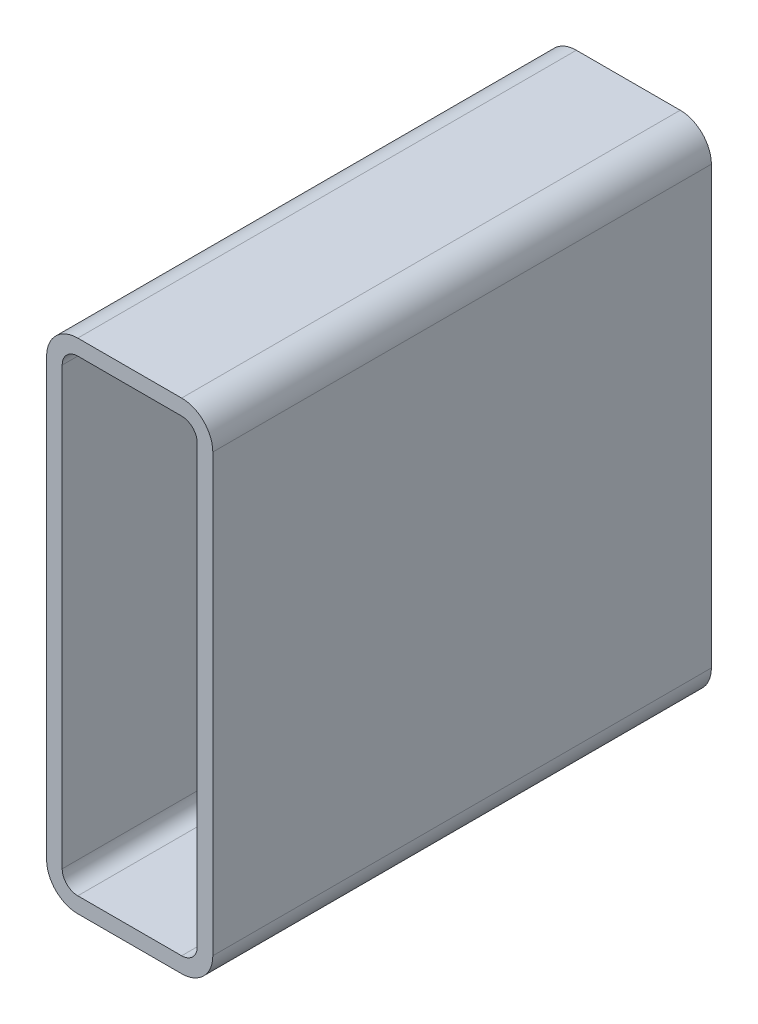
ISO-10303-21;
HEADER;
FILE_DESCRIPTION(('STEP AP214'),'2;1');
FILE_NAME('part.step','',(''),(''),'','','');
FILE_SCHEMA(('AUTOMOTIVE_DESIGN { 1 0 10303 214 1 1 1 1 }'));
ENDSEC;
DATA;
#1=APPLICATION_CONTEXT('core data for automotive mechanical design processes');
#2=APPLICATION_PROTOCOL_DEFINITION('international standard','automotive_design',2000,#1);
#3=PRODUCT_CONTEXT('',#1,'mechanical');
#4=PRODUCT('Part','Part','',(#3));
#5=PRODUCT_RELATED_PRODUCT_CATEGORY('part','',(#4));
#6=PRODUCT_DEFINITION_FORMATION('','',#4);
#7=PRODUCT_DEFINITION_CONTEXT('part definition',#1,'design');
#8=PRODUCT_DEFINITION('design','',#6,#7);
#9=PRODUCT_DEFINITION_SHAPE('','',#8);
#10=(LENGTH_UNIT() NAMED_UNIT(*) SI_UNIT(.MILLI.,.METRE.));
#11=(NAMED_UNIT(*) PLANE_ANGLE_UNIT() SI_UNIT($,.RADIAN.));
#12=(NAMED_UNIT(*) SI_UNIT($,.STERADIAN.) SOLID_ANGLE_UNIT());
#13=UNCERTAINTY_MEASURE_WITH_UNIT(LENGTH_MEASURE(1.E-05),#10,'distance_accuracy_value','');
#14=(GEOMETRIC_REPRESENTATION_CONTEXT(3) GLOBAL_UNCERTAINTY_ASSIGNED_CONTEXT((#13)) GLOBAL_UNIT_ASSIGNED_CONTEXT((#10,
#11,#12)) REPRESENTATION_CONTEXT('',''));
#15=CARTESIAN_POINT('',(0.,0.,0.));
#16=DIRECTION('',(0.,0.,1.));
#17=DIRECTION('',(1.,0.,0.));
#18=AXIS2_PLACEMENT_3D('',#15,#16,#17);
#19=CARTESIAN_POINT('',(20.7251778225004,287.624496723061,304.8));
#20=DIRECTION('',(0.,0.,1.));
#21=DIRECTION('',(1.,0.,0.));
#22=AXIS2_PLACEMENT_3D('',#19,#20,#21);
#23=PLANE('',#22);
#24=CARTESIAN_POINT('',(20.7251778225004,287.624496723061,304.8));
#25=DIRECTION('',(0.,0.,1.));
#26=DIRECTION('',(1.,0.,0.));
#27=AXIS2_PLACEMENT_3D('',#24,#25,#26);
#28=CIRCLE('',#27,19.05);
#29=CARTESIAN_POINT('',(20.7251778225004,306.674496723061,304.8));
#30=VERTEX_POINT('',#29);
#31=CARTESIAN_POINT('',(1.67517782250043,287.624496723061,304.8));
#32=VERTEX_POINT('',#31);
#33=EDGE_CURVE('E211',#30,#32,#28,.T.);
#34=ORIENTED_EDGE('',*,*,#33,.T.);
#35=DIRECTION('',(0.,-1.,0.));
#36=VECTOR('',#35,1.);
#37=CARTESIAN_POINT('',(1.67517782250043,20.9244967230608,304.8));
#38=LINE('',#37,#36);
#39=CARTESIAN_POINT('',(1.67517782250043,20.9244967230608,304.8));
#40=VERTEX_POINT('',#39);
#41=EDGE_CURVE('E214',#32,#40,#38,.T.);
#42=ORIENTED_EDGE('',*,*,#41,.T.);
#43=CARTESIAN_POINT('',(20.7251778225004,20.9244967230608,304.8));
#44=DIRECTION('',(0.,0.,1.));
#45=DIRECTION('',(1.,0.,0.));
#46=AXIS2_PLACEMENT_3D('',#43,#44,#45);
#47=CIRCLE('',#46,19.05);
#48=CARTESIAN_POINT('',(20.7251778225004,1.87449672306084,304.8));
#49=VERTEX_POINT('',#48);
#50=EDGE_CURVE('E217',#40,#49,#47,.T.);
#51=ORIENTED_EDGE('',*,*,#50,.T.);
#52=DIRECTION('',(1.,0.,0.));
#53=VECTOR('',#52,1.);
#54=CARTESIAN_POINT('',(84.2251778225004,1.87449672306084,304.8));
#55=LINE('',#54,#53);
#56=CARTESIAN_POINT('',(84.2251778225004,1.87449672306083,304.8));
#57=VERTEX_POINT('',#56);
#58=EDGE_CURVE('E219',#49,#57,#55,.T.);
#59=ORIENTED_EDGE('',*,*,#58,.T.);
#60=CARTESIAN_POINT('',(84.2251778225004,20.9244967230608,304.8));
#61=DIRECTION('',(0.,0.,1.));
#62=DIRECTION('',(1.,0.,0.));
#63=AXIS2_PLACEMENT_3D('',#60,#61,#62);
#64=CIRCLE('',#63,19.05);
#65=CARTESIAN_POINT('',(103.2751778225,20.9244967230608,304.8));
#66=VERTEX_POINT('',#65);
#67=EDGE_CURVE('E221',#57,#66,#64,.T.);
#68=ORIENTED_EDGE('',*,*,#67,.T.);
#69=DIRECTION('',(0.,1.,0.));
#70=VECTOR('',#69,1.);
#71=CARTESIAN_POINT('',(103.2751778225,287.624496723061,304.8));
#72=LINE('',#71,#70);
#73=CARTESIAN_POINT('',(103.2751778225,287.624496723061,304.8));
#74=VERTEX_POINT('',#73);
#75=EDGE_CURVE('E223',#66,#74,#72,.T.);
#76=ORIENTED_EDGE('',*,*,#75,.T.);
#77=CARTESIAN_POINT('',(84.2251778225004,287.624496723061,304.8));
#78=DIRECTION('',(0.,0.,1.));
#79=DIRECTION('',(1.,0.,0.));
#80=AXIS2_PLACEMENT_3D('',#77,#78,#79);
#81=CIRCLE('',#80,19.05);
#82=CARTESIAN_POINT('',(84.2251778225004,306.674496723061,304.8));
#83=VERTEX_POINT('',#82);
#84=EDGE_CURVE('E225',#74,#83,#81,.T.);
#85=ORIENTED_EDGE('',*,*,#84,.T.);
#86=DIRECTION('',(-1.,0.,0.));
#87=VECTOR('',#86,1.);
#88=CARTESIAN_POINT('',(20.7251778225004,306.674496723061,304.8));
#89=LINE('',#88,#87);
#90=EDGE_CURVE('E227',#83,#30,#89,.T.);
#91=ORIENTED_EDGE('',*,*,#90,.T.);
#92=EDGE_LOOP('',(#34,#42,#51,#59,#68,#76,#85,#91));
#93=FACE_BOUND('',#92,.T.);
#94=DIRECTION('',(0.,-1.,0.));
#95=VECTOR('',#94,1.);
#96=CARTESIAN_POINT('',(11.2001778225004,20.9244967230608,304.8));
#97=LINE('',#96,#95);
#98=CARTESIAN_POINT('',(11.2001778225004,287.624496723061,304.8));
#99=VERTEX_POINT('',#98);
#100=CARTESIAN_POINT('',(11.2001778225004,20.9244967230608,304.8));
#101=VERTEX_POINT('',#100);
#102=EDGE_CURVE('E154',#99,#101,#97,.T.);
#103=ORIENTED_EDGE('',*,*,#102,.F.);
#104=CARTESIAN_POINT('',(20.7251778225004,287.624496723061,304.8));
#105=DIRECTION('',(0.,0.,1.));
#106=DIRECTION('',(1.,0.,0.));
#107=AXIS2_PLACEMENT_3D('',#104,#105,#106);
#108=CIRCLE('',#107,9.52500000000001);
#109=CARTESIAN_POINT('',(20.7251778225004,297.149496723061,304.8));
#110=VERTEX_POINT('',#109);
#111=EDGE_CURVE('E146',#110,#99,#108,.T.);
#112=ORIENTED_EDGE('',*,*,#111,.F.);
#113=DIRECTION('',(-1.,0.,0.));
#114=VECTOR('',#113,1.);
#115=CARTESIAN_POINT('',(20.7251778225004,297.149496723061,304.8));
#116=LINE('',#115,#114);
#117=CARTESIAN_POINT('',(84.2251778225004,297.149496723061,304.8));
#118=VERTEX_POINT('',#117);
#119=EDGE_CURVE('E179',#118,#110,#116,.T.);
#120=ORIENTED_EDGE('',*,*,#119,.F.);
#121=CARTESIAN_POINT('',(84.2251778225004,287.624496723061,304.8));
#122=DIRECTION('',(0.,0.,1.));
#123=DIRECTION('',(1.,0.,0.));
#124=AXIS2_PLACEMENT_3D('',#121,#122,#123);
#125=CIRCLE('',#124,9.52500000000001);
#126=CARTESIAN_POINT('',(93.7501778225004,287.624496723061,304.8));
#127=VERTEX_POINT('',#126);
#128=EDGE_CURVE('E177',#127,#118,#125,.T.);
#129=ORIENTED_EDGE('',*,*,#128,.F.);
#130=DIRECTION('',(0.,1.,0.));
#131=VECTOR('',#130,1.);
#132=CARTESIAN_POINT('',(93.7501778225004,287.624496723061,304.8));
#133=LINE('',#132,#131);
#134=CARTESIAN_POINT('',(93.7501778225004,20.9244967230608,304.8));
#135=VERTEX_POINT('',#134);
#136=EDGE_CURVE('E175',#135,#127,#133,.T.);
#137=ORIENTED_EDGE('',*,*,#136,.F.);
#138=CARTESIAN_POINT('',(84.2251778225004,20.9244967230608,304.8));
#139=DIRECTION('',(0.,0.,1.));
#140=DIRECTION('',(1.,0.,0.));
#141=AXIS2_PLACEMENT_3D('',#138,#139,#140);
#142=CIRCLE('',#141,9.52500000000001);
#143=CARTESIAN_POINT('',(84.2251778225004,11.3994967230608,304.8));
#144=VERTEX_POINT('',#143);
#145=EDGE_CURVE('E173',#144,#135,#142,.T.);
#146=ORIENTED_EDGE('',*,*,#145,.F.);
#147=DIRECTION('',(1.,0.,0.));
#148=VECTOR('',#147,1.);
#149=CARTESIAN_POINT('',(84.2251778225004,11.3994967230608,304.8));
#150=LINE('',#149,#148);
#151=CARTESIAN_POINT('',(20.7251778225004,11.3994967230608,304.8));
#152=VERTEX_POINT('',#151);
#153=EDGE_CURVE('E169',#152,#144,#150,.T.);
#154=ORIENTED_EDGE('',*,*,#153,.F.);
#155=CARTESIAN_POINT('',(20.7251778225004,20.9244967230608,304.8));
#156=DIRECTION('',(0.,0.,1.));
#157=DIRECTION('',(1.,0.,0.));
#158=AXIS2_PLACEMENT_3D('',#155,#156,#157);
#159=CIRCLE('',#158,9.525);
#160=EDGE_CURVE('E167',#101,#152,#159,.T.);
#161=ORIENTED_EDGE('',*,*,#160,.F.);
#162=EDGE_LOOP('',(#103,#112,#120,#129,#137,#146,#154,#161));
#163=FACE_BOUND('',#162,.T.);
#164=ADVANCED_FACE('F33',(#93,#163),#23,.T.);
#165=CARTESIAN_POINT('',(20.7251778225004,287.624496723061,0.));
#166=DIRECTION('',(0.,0.,1.));
#167=DIRECTION('',(1.,0.,0.));
#168=AXIS2_PLACEMENT_3D('',#165,#166,#167);
#169=PLANE('',#168);
#170=CARTESIAN_POINT('',(20.7251778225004,287.624496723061,0.));
#171=DIRECTION('',(0.,0.,1.));
#172=DIRECTION('',(1.,0.,0.));
#173=AXIS2_PLACEMENT_3D('',#170,#171,#172);
#174=CIRCLE('',#173,19.05);
#175=CARTESIAN_POINT('',(20.7251778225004,306.674496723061,0.));
#176=VERTEX_POINT('',#175);
#177=CARTESIAN_POINT('',(1.67517782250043,287.624496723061,0.));
#178=VERTEX_POINT('',#177);
#179=EDGE_CURVE('E162',#176,#178,#174,.T.);
#180=ORIENTED_EDGE('',*,*,#179,.F.);
#181=DIRECTION('',(-1.,0.,0.));
#182=VECTOR('',#181,1.);
#183=CARTESIAN_POINT('',(20.7251778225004,306.674496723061,0.));
#184=LINE('',#183,#182);
#185=CARTESIAN_POINT('',(84.2251778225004,306.674496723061,0.));
#186=VERTEX_POINT('',#185);
#187=EDGE_CURVE('E215',#186,#176,#184,.T.);
#188=ORIENTED_EDGE('',*,*,#187,.F.);
#189=CARTESIAN_POINT('',(84.2251778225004,287.624496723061,0.));
#190=DIRECTION('',(0.,0.,1.));
#191=DIRECTION('',(1.,0.,0.));
#192=AXIS2_PLACEMENT_3D('',#189,#190,#191);
#193=CIRCLE('',#192,19.05);
#194=CARTESIAN_POINT('',(103.2751778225,287.624496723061,0.));
#195=VERTEX_POINT('',#194);
#196=EDGE_CURVE('E242',#195,#186,#193,.T.);
#197=ORIENTED_EDGE('',*,*,#196,.F.);
#198=DIRECTION('',(0.,1.,0.));
#199=VECTOR('',#198,1.);
#200=CARTESIAN_POINT('',(103.2751778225,287.624496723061,0.));
#201=LINE('',#200,#199);
#202=CARTESIAN_POINT('',(103.2751778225,20.9244967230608,0.));
#203=VERTEX_POINT('',#202);
#204=EDGE_CURVE('E240',#203,#195,#201,.T.);
#205=ORIENTED_EDGE('',*,*,#204,.F.);
#206=CARTESIAN_POINT('',(84.2251778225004,20.9244967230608,0.));
#207=DIRECTION('',(0.,0.,1.));
#208=DIRECTION('',(1.,0.,0.));
#209=AXIS2_PLACEMENT_3D('',#206,#207,#208);
#210=CIRCLE('',#209,19.05);
#211=CARTESIAN_POINT('',(84.2251778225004,1.87449672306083,0.));
#212=VERTEX_POINT('',#211);
#213=EDGE_CURVE('E238',#212,#203,#210,.T.);
#214=ORIENTED_EDGE('',*,*,#213,.F.);
#215=DIRECTION('',(1.,0.,0.));
#216=VECTOR('',#215,1.);
#217=CARTESIAN_POINT('',(84.2251778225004,1.87449672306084,0.));
#218=LINE('',#217,#216);
#219=CARTESIAN_POINT('',(20.7251778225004,1.87449672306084,0.));
#220=VERTEX_POINT('',#219);
#221=EDGE_CURVE('E236',#220,#212,#218,.T.);
#222=ORIENTED_EDGE('',*,*,#221,.F.);
#223=CARTESIAN_POINT('',(20.7251778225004,20.9244967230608,0.));
#224=DIRECTION('',(0.,0.,1.));
#225=DIRECTION('',(1.,0.,0.));
#226=AXIS2_PLACEMENT_3D('',#223,#224,#225);
#227=CIRCLE('',#226,19.05);
#228=CARTESIAN_POINT('',(1.67517782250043,20.9244967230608,0.));
#229=VERTEX_POINT('',#228);
#230=EDGE_CURVE('E234',#229,#220,#227,.T.);
#231=ORIENTED_EDGE('',*,*,#230,.F.);
#232=DIRECTION('',(0.,-1.,0.));
#233=VECTOR('',#232,1.);
#234=CARTESIAN_POINT('',(1.67517782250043,20.9244967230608,0.));
#235=LINE('',#234,#233);
#236=EDGE_CURVE('E232',#178,#229,#235,.T.);
#237=ORIENTED_EDGE('',*,*,#236,.F.);
#238=EDGE_LOOP('',(#180,#188,#197,#205,#214,#222,#231,#237));
#239=FACE_BOUND('',#238,.T.);
#240=CARTESIAN_POINT('',(20.7251778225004,287.624496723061,0.));
#241=DIRECTION('',(0.,0.,1.));
#242=DIRECTION('',(1.,0.,0.));
#243=AXIS2_PLACEMENT_3D('',#240,#241,#242);
#244=CIRCLE('',#243,9.52500000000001);
#245=CARTESIAN_POINT('',(20.7251778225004,297.149496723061,0.));
#246=VERTEX_POINT('',#245);
#247=CARTESIAN_POINT('',(11.2001778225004,287.624496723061,0.));
#248=VERTEX_POINT('',#247);
#249=EDGE_CURVE('E56',#246,#248,#244,.T.);
#250=ORIENTED_EDGE('',*,*,#249,.T.);
#251=DIRECTION('',(0.,-1.,0.));
#252=VECTOR('',#251,1.);
#253=CARTESIAN_POINT('',(11.2001778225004,20.9244967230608,0.));
#254=LINE('',#253,#252);
#255=CARTESIAN_POINT('',(11.2001778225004,20.9244967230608,0.));
#256=VERTEX_POINT('',#255);
#257=EDGE_CURVE('E161',#248,#256,#254,.T.);
#258=ORIENTED_EDGE('',*,*,#257,.T.);
#259=CARTESIAN_POINT('',(20.7251778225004,20.9244967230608,0.));
#260=DIRECTION('',(0.,0.,1.));
#261=DIRECTION('',(1.,0.,0.));
#262=AXIS2_PLACEMENT_3D('',#259,#260,#261);
#263=CIRCLE('',#262,9.525);
#264=CARTESIAN_POINT('',(20.7251778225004,11.3994967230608,0.));
#265=VERTEX_POINT('',#264);
#266=EDGE_CURVE('E183',#256,#265,#263,.T.);
#267=ORIENTED_EDGE('',*,*,#266,.T.);
#268=DIRECTION('',(1.,0.,0.));
#269=VECTOR('',#268,1.);
#270=CARTESIAN_POINT('',(84.2251778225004,11.3994967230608,0.));
#271=LINE('',#270,#269);
#272=CARTESIAN_POINT('',(84.2251778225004,11.3994967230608,0.));
#273=VERTEX_POINT('',#272);
#274=EDGE_CURVE('E186',#265,#273,#271,.T.);
#275=ORIENTED_EDGE('',*,*,#274,.T.);
#276=CARTESIAN_POINT('',(84.2251778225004,20.9244967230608,0.));
#277=DIRECTION('',(0.,0.,1.));
#278=DIRECTION('',(1.,0.,0.));
#279=AXIS2_PLACEMENT_3D('',#276,#277,#278);
#280=CIRCLE('',#279,9.52500000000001);
#281=CARTESIAN_POINT('',(93.7501778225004,20.9244967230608,0.));
#282=VERTEX_POINT('',#281);
#283=EDGE_CURVE('E189',#273,#282,#280,.T.);
#284=ORIENTED_EDGE('',*,*,#283,.T.);
#285=DIRECTION('',(0.,1.,0.));
#286=VECTOR('',#285,1.);
#287=CARTESIAN_POINT('',(93.7501778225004,287.624496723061,0.));
#288=LINE('',#287,#286);
#289=CARTESIAN_POINT('',(93.7501778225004,287.624496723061,0.));
#290=VERTEX_POINT('',#289);
#291=EDGE_CURVE('E192',#282,#290,#288,.T.);
#292=ORIENTED_EDGE('',*,*,#291,.T.);
#293=CARTESIAN_POINT('',(84.2251778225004,287.624496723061,0.));
#294=DIRECTION('',(0.,0.,1.));
#295=DIRECTION('',(1.,0.,0.));
#296=AXIS2_PLACEMENT_3D('',#293,#294,#295);
#297=CIRCLE('',#296,9.52500000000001);
#298=CARTESIAN_POINT('',(84.2251778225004,297.149496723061,0.));
#299=VERTEX_POINT('',#298);
#300=EDGE_CURVE('E195',#290,#299,#297,.T.);
#301=ORIENTED_EDGE('',*,*,#300,.T.);
#302=DIRECTION('',(-1.,0.,0.));
#303=VECTOR('',#302,1.);
#304=CARTESIAN_POINT('',(20.7251778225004,297.149496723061,0.));
#305=LINE('',#304,#303);
#306=EDGE_CURVE('E155',#299,#246,#305,.T.);
#307=ORIENTED_EDGE('',*,*,#306,.T.);
#308=EDGE_LOOP('',(#250,#258,#267,#275,#284,#292,#301,#307));
#309=FACE_BOUND('',#308,.T.);
#310=ADVANCED_FACE('F272',(#239,#309),#169,.F.);
#311=CARTESIAN_POINT('',(20.7251778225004,287.624496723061,304.8));
#312=DIRECTION('',(0.,0.,-1.));
#313=DIRECTION('',(-1.,0.,0.));
#314=AXIS2_PLACEMENT_3D('',#311,#312,#313);
#315=CYLINDRICAL_SURFACE('',#314,19.05);
#316=ORIENTED_EDGE('',*,*,#179,.T.);
#317=DIRECTION('',(0.,0.,-1.));
#318=VECTOR('',#317,1.);
#319=CARTESIAN_POINT('',(1.67517782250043,287.624496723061,304.8));
#320=LINE('',#319,#318);
#321=EDGE_CURVE('E11',#32,#178,#320,.T.);
#322=ORIENTED_EDGE('',*,*,#321,.F.);
#323=ORIENTED_EDGE('',*,*,#33,.F.);
#324=DIRECTION('',(0.,0.,-1.));
#325=VECTOR('',#324,1.);
#326=CARTESIAN_POINT('',(20.7251778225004,306.674496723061,304.8));
#327=LINE('',#326,#325);
#328=EDGE_CURVE('E229',#30,#176,#327,.T.);
#329=ORIENTED_EDGE('',*,*,#328,.T.);
#330=EDGE_LOOP('',(#316,#322,#323,#329));
#331=FACE_BOUND('',#330,.T.);
#332=ADVANCED_FACE('F35',(#331),#315,.T.);
#333=CARTESIAN_POINT('',(1.67517782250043,20.9244967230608,304.8));
#334=DIRECTION('',(1.,0.,0.));
#335=DIRECTION('',(0.,0.,-1.));
#336=AXIS2_PLACEMENT_3D('',#333,#334,#335);
#337=PLANE('',#336);
#338=ORIENTED_EDGE('',*,*,#236,.T.);
#339=DIRECTION('',(0.,0.,-1.));
#340=VECTOR('',#339,1.);
#341=CARTESIAN_POINT('',(1.67517782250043,20.9244967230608,304.8));
#342=LINE('',#341,#340);
#343=EDGE_CURVE('E41',#40,#229,#342,.T.);
#344=ORIENTED_EDGE('',*,*,#343,.F.);
#345=ORIENTED_EDGE('',*,*,#41,.F.);
#346=ORIENTED_EDGE('',*,*,#321,.T.);
#347=EDGE_LOOP('',(#338,#344,#345,#346));
#348=FACE_BOUND('',#347,.T.);
#349=ADVANCED_FACE('F289',(#348),#337,.F.);
#350=CARTESIAN_POINT('',(20.7251778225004,20.9244967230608,304.8));
#351=DIRECTION('',(0.,0.,-1.));
#352=DIRECTION('',(-1.,0.,0.));
#353=AXIS2_PLACEMENT_3D('',#350,#351,#352);
#354=CYLINDRICAL_SURFACE('',#353,19.05);
#355=ORIENTED_EDGE('',*,*,#230,.T.);
#356=DIRECTION('',(0.,0.,-1.));
#357=VECTOR('',#356,1.);
#358=CARTESIAN_POINT('',(20.7251778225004,1.87449672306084,304.8));
#359=LINE('',#358,#357);
#360=EDGE_CURVE('E259',#49,#220,#359,.T.);
#361=ORIENTED_EDGE('',*,*,#360,.F.);
#362=ORIENTED_EDGE('',*,*,#50,.F.);
#363=ORIENTED_EDGE('',*,*,#343,.T.);
#364=EDGE_LOOP('',(#355,#361,#362,#363));
#365=FACE_BOUND('',#364,.T.);
#366=ADVANCED_FACE('F266',(#365),#354,.T.);
#367=CARTESIAN_POINT('',(84.2251778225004,1.87449672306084,304.8));
#368=DIRECTION('',(0.,1.,0.));
#369=DIRECTION('',(0.,0.,1.));
#370=AXIS2_PLACEMENT_3D('',#367,#368,#369);
#371=PLANE('',#370);
#372=ORIENTED_EDGE('',*,*,#221,.T.);
#373=DIRECTION('',(0.,0.,-1.));
#374=VECTOR('',#373,1.);
#375=CARTESIAN_POINT('',(84.2251778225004,1.87449672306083,304.8));
#376=LINE('',#375,#374);
#377=EDGE_CURVE('E256',#57,#212,#376,.T.);
#378=ORIENTED_EDGE('',*,*,#377,.F.);
#379=ORIENTED_EDGE('',*,*,#58,.F.);
#380=ORIENTED_EDGE('',*,*,#360,.T.);
#381=EDGE_LOOP('',(#372,#378,#379,#380));
#382=FACE_BOUND('',#381,.T.);
#383=ADVANCED_FACE('F278',(#382),#371,.F.);
#384=CARTESIAN_POINT('',(84.2251778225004,20.9244967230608,304.8));
#385=DIRECTION('',(0.,0.,-1.));
#386=DIRECTION('',(-1.,0.,0.));
#387=AXIS2_PLACEMENT_3D('',#384,#385,#386);
#388=CYLINDRICAL_SURFACE('',#387,19.05);
#389=ORIENTED_EDGE('',*,*,#213,.T.);
#390=DIRECTION('',(0.,0.,-1.));
#391=VECTOR('',#390,1.);
#392=CARTESIAN_POINT('',(103.2751778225,20.9244967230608,304.8));
#393=LINE('',#392,#391);
#394=EDGE_CURVE('E253',#66,#203,#393,.T.);
#395=ORIENTED_EDGE('',*,*,#394,.F.);
#396=ORIENTED_EDGE('',*,*,#67,.F.);
#397=ORIENTED_EDGE('',*,*,#377,.T.);
#398=EDGE_LOOP('',(#389,#395,#396,#397));
#399=FACE_BOUND('',#398,.T.);
#400=ADVANCED_FACE('F282',(#399),#388,.T.);
#401=CARTESIAN_POINT('',(103.2751778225,287.624496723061,304.8));
#402=DIRECTION('',(-1.,0.,0.));
#403=DIRECTION('',(0.,0.,1.));
#404=AXIS2_PLACEMENT_3D('',#401,#402,#403);
#405=PLANE('',#404);
#406=ORIENTED_EDGE('',*,*,#204,.T.);
#407=DIRECTION('',(0.,0.,-1.));
#408=VECTOR('',#407,1.);
#409=CARTESIAN_POINT('',(103.2751778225,287.624496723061,304.8));
#410=LINE('',#409,#408);
#411=EDGE_CURVE('E250',#74,#195,#410,.T.);
#412=ORIENTED_EDGE('',*,*,#411,.F.);
#413=ORIENTED_EDGE('',*,*,#75,.F.);
#414=ORIENTED_EDGE('',*,*,#394,.T.);
#415=EDGE_LOOP('',(#406,#412,#413,#414));
#416=FACE_BOUND('',#415,.T.);
#417=ADVANCED_FACE('F302',(#416),#405,.F.);
#418=CARTESIAN_POINT('',(84.2251778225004,287.624496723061,304.8));
#419=DIRECTION('',(0.,0.,-1.));
#420=DIRECTION('',(-1.,0.,0.));
#421=AXIS2_PLACEMENT_3D('',#418,#419,#420);
#422=CYLINDRICAL_SURFACE('',#421,19.05);
#423=ORIENTED_EDGE('',*,*,#196,.T.);
#424=DIRECTION('',(0.,0.,-1.));
#425=VECTOR('',#424,1.);
#426=CARTESIAN_POINT('',(84.2251778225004,306.674496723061,304.8));
#427=LINE('',#426,#425);
#428=EDGE_CURVE('E247',#83,#186,#427,.T.);
#429=ORIENTED_EDGE('',*,*,#428,.F.);
#430=ORIENTED_EDGE('',*,*,#84,.F.);
#431=ORIENTED_EDGE('',*,*,#411,.T.);
#432=EDGE_LOOP('',(#423,#429,#430,#431));
#433=FACE_BOUND('',#432,.T.);
#434=ADVANCED_FACE('F300',(#433),#422,.T.);
#435=CARTESIAN_POINT('',(20.7251778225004,306.674496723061,304.8));
#436=DIRECTION('',(0.,-1.,0.));
#437=DIRECTION('',(0.,0.,-1.));
#438=AXIS2_PLACEMENT_3D('',#435,#436,#437);
#439=PLANE('',#438);
#440=ORIENTED_EDGE('',*,*,#187,.T.);
#441=ORIENTED_EDGE('',*,*,#328,.F.);
#442=ORIENTED_EDGE('',*,*,#90,.F.);
#443=ORIENTED_EDGE('',*,*,#428,.T.);
#444=EDGE_LOOP('',(#440,#441,#442,#443));
#445=FACE_BOUND('',#444,.T.);
#446=ADVANCED_FACE('F295',(#445),#439,.F.);
#447=CARTESIAN_POINT('',(20.7251778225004,287.624496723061,304.8));
#448=DIRECTION('',(0.,0.,-1.));
#449=DIRECTION('',(-1.,0.,0.));
#450=AXIS2_PLACEMENT_3D('',#447,#448,#449);
#451=CYLINDRICAL_SURFACE('',#450,9.52500000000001);
#452=ORIENTED_EDGE('',*,*,#249,.F.);
#453=DIRECTION('',(0.,0.,-1.));
#454=VECTOR('',#453,1.);
#455=CARTESIAN_POINT('',(20.7251778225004,297.149496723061,304.8));
#456=LINE('',#455,#454);
#457=EDGE_CURVE('E150',#110,#246,#456,.T.);
#458=ORIENTED_EDGE('',*,*,#457,.F.);
#459=ORIENTED_EDGE('',*,*,#111,.T.);
#460=DIRECTION('',(0.,0.,-1.));
#461=VECTOR('',#460,1.);
#462=CARTESIAN_POINT('',(11.2001778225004,287.624496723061,304.8));
#463=LINE('',#462,#461);
#464=EDGE_CURVE('E149',#99,#248,#463,.T.);
#465=ORIENTED_EDGE('',*,*,#464,.T.);
#466=EDGE_LOOP('',(#452,#458,#459,#465));
#467=FACE_BOUND('',#466,.T.);
#468=ADVANCED_FACE('F148',(#467),#451,.F.);
#469=CARTESIAN_POINT('',(11.2001778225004,20.9244967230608,304.8));
#470=DIRECTION('',(1.,0.,0.));
#471=DIRECTION('',(0.,0.,-1.));
#472=AXIS2_PLACEMENT_3D('',#469,#470,#471);
#473=PLANE('',#472);
#474=ORIENTED_EDGE('',*,*,#257,.F.);
#475=ORIENTED_EDGE('',*,*,#464,.F.);
#476=ORIENTED_EDGE('',*,*,#102,.T.);
#477=DIRECTION('',(0.,0.,-1.));
#478=VECTOR('',#477,1.);
#479=CARTESIAN_POINT('',(11.2001778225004,20.9244967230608,304.8));
#480=LINE('',#479,#478);
#481=EDGE_CURVE('E163',#101,#256,#480,.T.);
#482=ORIENTED_EDGE('',*,*,#481,.T.);
#483=EDGE_LOOP('',(#474,#475,#476,#482));
#484=FACE_BOUND('',#483,.T.);
#485=ADVANCED_FACE('F158',(#484),#473,.T.);
#486=CARTESIAN_POINT('',(20.7251778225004,20.9244967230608,304.8));
#487=DIRECTION('',(0.,0.,-1.));
#488=DIRECTION('',(-1.,0.,0.));
#489=AXIS2_PLACEMENT_3D('',#486,#487,#488);
#490=CYLINDRICAL_SURFACE('',#489,9.525);
#491=ORIENTED_EDGE('',*,*,#266,.F.);
#492=ORIENTED_EDGE('',*,*,#481,.F.);
#493=ORIENTED_EDGE('',*,*,#160,.T.);
#494=DIRECTION('',(0.,0.,-1.));
#495=VECTOR('',#494,1.);
#496=CARTESIAN_POINT('',(20.7251778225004,11.3994967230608,304.8));
#497=LINE('',#496,#495);
#498=EDGE_CURVE('E208',#152,#265,#497,.T.);
#499=ORIENTED_EDGE('',*,*,#498,.T.);
#500=EDGE_LOOP('',(#491,#492,#493,#499));
#501=FACE_BOUND('',#500,.T.);
#502=ADVANCED_FACE('F327',(#501),#490,.F.);
#503=CARTESIAN_POINT('',(84.2251778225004,11.3994967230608,304.8));
#504=DIRECTION('',(0.,1.,0.));
#505=DIRECTION('',(0.,0.,1.));
#506=AXIS2_PLACEMENT_3D('',#503,#504,#505);
#507=PLANE('',#506);
#508=ORIENTED_EDGE('',*,*,#274,.F.);
#509=ORIENTED_EDGE('',*,*,#498,.F.);
#510=ORIENTED_EDGE('',*,*,#153,.T.);
#511=DIRECTION('',(0.,0.,-1.));
#512=VECTOR('',#511,1.);
#513=CARTESIAN_POINT('',(84.2251778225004,11.3994967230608,304.8));
#514=LINE('',#513,#512);
#515=EDGE_CURVE('E206',#144,#273,#514,.T.);
#516=ORIENTED_EDGE('',*,*,#515,.T.);
#517=EDGE_LOOP('',(#508,#509,#510,#516));
#518=FACE_BOUND('',#517,.T.);
#519=ADVANCED_FACE('F331',(#518),#507,.T.);
#520=CARTESIAN_POINT('',(84.2251778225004,20.9244967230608,304.8));
#521=DIRECTION('',(0.,0.,-1.));
#522=DIRECTION('',(-1.,0.,0.));
#523=AXIS2_PLACEMENT_3D('',#520,#521,#522);
#524=CYLINDRICAL_SURFACE('',#523,9.52500000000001);
#525=ORIENTED_EDGE('',*,*,#283,.F.);
#526=ORIENTED_EDGE('',*,*,#515,.F.);
#527=ORIENTED_EDGE('',*,*,#145,.T.);
#528=DIRECTION('',(0.,0.,-1.));
#529=VECTOR('',#528,1.);
#530=CARTESIAN_POINT('',(93.7501778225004,20.9244967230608,304.8));
#531=LINE('',#530,#529);
#532=EDGE_CURVE('E204',#135,#282,#531,.T.);
#533=ORIENTED_EDGE('',*,*,#532,.T.);
#534=EDGE_LOOP('',(#525,#526,#527,#533));
#535=FACE_BOUND('',#534,.T.);
#536=ADVANCED_FACE('F337',(#535),#524,.F.);
#537=CARTESIAN_POINT('',(93.7501778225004,287.624496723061,304.8));
#538=DIRECTION('',(-1.,0.,0.));
#539=DIRECTION('',(0.,0.,1.));
#540=AXIS2_PLACEMENT_3D('',#537,#538,#539);
#541=PLANE('',#540);
#542=ORIENTED_EDGE('',*,*,#291,.F.);
#543=ORIENTED_EDGE('',*,*,#532,.F.);
#544=ORIENTED_EDGE('',*,*,#136,.T.);
#545=DIRECTION('',(0.,0.,-1.));
#546=VECTOR('',#545,1.);
#547=CARTESIAN_POINT('',(93.7501778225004,287.624496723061,304.8));
#548=LINE('',#547,#546);
#549=EDGE_CURVE('E202',#127,#290,#548,.T.);
#550=ORIENTED_EDGE('',*,*,#549,.T.);
#551=EDGE_LOOP('',(#542,#543,#544,#550));
#552=FACE_BOUND('',#551,.T.);
#553=ADVANCED_FACE('F341',(#552),#541,.T.);
#554=CARTESIAN_POINT('',(84.2251778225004,287.624496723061,304.8));
#555=DIRECTION('',(0.,0.,-1.));
#556=DIRECTION('',(-1.,0.,0.));
#557=AXIS2_PLACEMENT_3D('',#554,#555,#556);
#558=CYLINDRICAL_SURFACE('',#557,9.52500000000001);
#559=ORIENTED_EDGE('',*,*,#300,.F.);
#560=ORIENTED_EDGE('',*,*,#549,.F.);
#561=ORIENTED_EDGE('',*,*,#128,.T.);
#562=DIRECTION('',(0.,0.,-1.));
#563=VECTOR('',#562,1.);
#564=CARTESIAN_POINT('',(84.2251778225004,297.149496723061,304.8));
#565=LINE('',#564,#563);
#566=EDGE_CURVE('E48',#118,#299,#565,.T.);
#567=ORIENTED_EDGE('',*,*,#566,.T.);
#568=EDGE_LOOP('',(#559,#560,#561,#567));
#569=FACE_BOUND('',#568,.T.);
#570=ADVANCED_FACE('F345',(#569),#558,.F.);
#571=CARTESIAN_POINT('',(20.7251778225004,297.149496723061,304.8));
#572=DIRECTION('',(0.,-1.,0.));
#573=DIRECTION('',(0.,0.,-1.));
#574=AXIS2_PLACEMENT_3D('',#571,#572,#573);
#575=PLANE('',#574);
#576=ORIENTED_EDGE('',*,*,#306,.F.);
#577=ORIENTED_EDGE('',*,*,#566,.F.);
#578=ORIENTED_EDGE('',*,*,#119,.T.);
#579=ORIENTED_EDGE('',*,*,#457,.T.);
#580=EDGE_LOOP('',(#576,#577,#578,#579));
#581=FACE_BOUND('',#580,.T.);
#582=ADVANCED_FACE('F349',(#581),#575,.T.);
#583=CLOSED_SHELL('',(#164,#310,#332,#349,#366,#383,#400,#417,#434,#446,#468,#485,#502,#519,
#536,#553,#570,#582));
#584=MANIFOLD_SOLID_BREP('B2',#583);
#585=ADVANCED_BREP_SHAPE_REPRESENTATION('',(#18,#584),#14);
#586=SHAPE_DEFINITION_REPRESENTATION(#9,#585);
ENDSEC;
END-ISO-10303-21;
